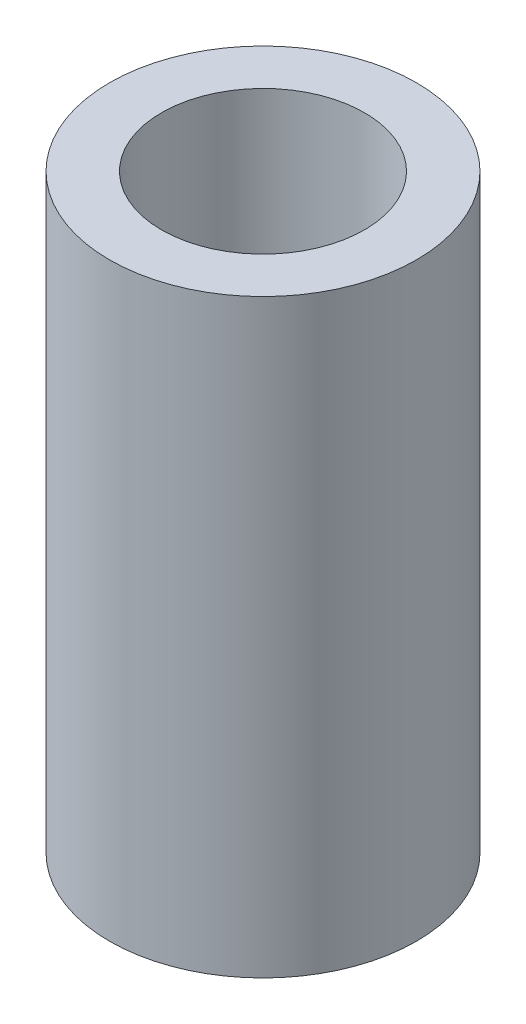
ISO-10303-21;
HEADER;
FILE_DESCRIPTION(('STEP AP214'),'2;1');
FILE_NAME('part.step','',(''),(''),'','','');
FILE_SCHEMA(('AUTOMOTIVE_DESIGN { 1 0 10303 214 1 1 1 1 }'));
ENDSEC;
DATA;
#1=APPLICATION_CONTEXT('core data for automotive mechanical design processes');
#2=APPLICATION_PROTOCOL_DEFINITION('international standard','automotive_design',2000,#1);
#3=PRODUCT_CONTEXT('',#1,'mechanical');
#4=PRODUCT('Part','Part','',(#3));
#5=PRODUCT_RELATED_PRODUCT_CATEGORY('part','',(#4));
#6=PRODUCT_DEFINITION_FORMATION('','',#4);
#7=PRODUCT_DEFINITION_CONTEXT('part definition',#1,'design');
#8=PRODUCT_DEFINITION('design','',#6,#7);
#9=PRODUCT_DEFINITION_SHAPE('','',#8);
#10=(LENGTH_UNIT() NAMED_UNIT(*) SI_UNIT(.MILLI.,.METRE.));
#11=(NAMED_UNIT(*) PLANE_ANGLE_UNIT() SI_UNIT($,.RADIAN.));
#12=(NAMED_UNIT(*) SI_UNIT($,.STERADIAN.) SOLID_ANGLE_UNIT());
#13=UNCERTAINTY_MEASURE_WITH_UNIT(LENGTH_MEASURE(1.E-05),#10,'distance_accuracy_value','');
#14=(GEOMETRIC_REPRESENTATION_CONTEXT(3) GLOBAL_UNCERTAINTY_ASSIGNED_CONTEXT((#13)) GLOBAL_UNIT_ASSIGNED_CONTEXT((#10,
#11,#12)) REPRESENTATION_CONTEXT('',''));
#15=CARTESIAN_POINT('',(0.,0.,0.));
#16=DIRECTION('',(0.,0.,1.));
#17=DIRECTION('',(1.,0.,0.));
#18=AXIS2_PLACEMENT_3D('',#15,#16,#17);
#19=CARTESIAN_POINT('',(0.,-35.,13.55));
#20=DIRECTION('',(0.,1.,0.));
#21=DIRECTION('',(0.,0.,1.));
#22=AXIS2_PLACEMENT_3D('',#19,#20,#21);
#23=CYLINDRICAL_SURFACE('',#22,2.15);
#24=DIRECTION('',(0.,1.,0.));
#25=VECTOR('',#24,1.);
#26=CARTESIAN_POINT('',(0.,-35.,15.7));
#27=LINE('',#26,#25);
#28=CARTESIAN_POINT('',(0.,-35.,15.7));
#29=VERTEX_POINT('',#28);
#30=CARTESIAN_POINT('',(0.,-22.5,15.7));
#31=VERTEX_POINT('',#30);
#32=EDGE_CURVE('E10',#29,#31,#27,.T.);
#33=ORIENTED_EDGE('',*,*,#32,.F.);
#34=CARTESIAN_POINT('',(0.,-35.,13.55));
#35=DIRECTION('',(0.,1.,0.));
#36=DIRECTION('',(0.,0.,1.));
#37=AXIS2_PLACEMENT_3D('',#34,#35,#36);
#38=CIRCLE('',#37,2.15);
#39=EDGE_CURVE('E27',#29,#29,#38,.T.);
#40=ORIENTED_EDGE('',*,*,#39,.F.);
#41=ORIENTED_EDGE('',*,*,#32,.T.);
#42=CARTESIAN_POINT('',(0.,-22.5,13.55));
#43=DIRECTION('',(0.,1.,0.));
#44=DIRECTION('',(0.,0.,1.));
#45=AXIS2_PLACEMENT_3D('',#42,#43,#44);
#46=CIRCLE('',#45,2.15);
#47=EDGE_CURVE('E58',#31,#31,#46,.T.);
#48=ORIENTED_EDGE('',*,*,#47,.T.);
#49=EDGE_LOOP('',(#33,#40,#41,#48));
#50=FACE_BOUND('',#49,.T.);
#51=ADVANCED_FACE('F16',(#50),#23,.F.);
#52=CARTESIAN_POINT('',(0.,-35.,13.55));
#53=DIRECTION('',(0.,1.,0.));
#54=DIRECTION('',(0.,0.,-1.));
#55=AXIS2_PLACEMENT_3D('',#52,#53,#54);
#56=PLANE('',#55);
#57=ORIENTED_EDGE('',*,*,#39,.T.);
#58=EDGE_LOOP('',(#57));
#59=FACE_BOUND('',#58,.T.);
#60=CARTESIAN_POINT('',(0.,-35.,13.55));
#61=DIRECTION('',(0.,1.,0.));
#62=DIRECTION('',(0.,0.,1.));
#63=AXIS2_PLACEMENT_3D('',#60,#61,#62);
#64=CIRCLE('',#63,3.25);
#65=CARTESIAN_POINT('',(0.,-35.,16.8));
#66=VERTEX_POINT('',#65);
#67=EDGE_CURVE('E54',#66,#66,#64,.T.);
#68=ORIENTED_EDGE('',*,*,#67,.F.);
#69=EDGE_LOOP('',(#68));
#70=FACE_BOUND('',#69,.T.);
#71=ADVANCED_FACE('F69',(#59,#70),#56,.F.);
#72=CARTESIAN_POINT('',(0.,-22.5,13.55));
#73=DIRECTION('',(0.,1.,0.));
#74=DIRECTION('',(0.,0.,-1.));
#75=AXIS2_PLACEMENT_3D('',#72,#73,#74);
#76=PLANE('',#75);
#77=ORIENTED_EDGE('',*,*,#47,.F.);
#78=EDGE_LOOP('',(#77));
#79=FACE_BOUND('',#78,.T.);
#80=CARTESIAN_POINT('',(0.,-22.5,13.55));
#81=DIRECTION('',(0.,1.,0.));
#82=DIRECTION('',(0.,0.,1.));
#83=AXIS2_PLACEMENT_3D('',#80,#81,#82);
#84=CIRCLE('',#83,3.25);
#85=CARTESIAN_POINT('',(0.,-22.5,16.8));
#86=VERTEX_POINT('',#85);
#87=EDGE_CURVE('E20',#86,#86,#84,.T.);
#88=ORIENTED_EDGE('',*,*,#87,.T.);
#89=EDGE_LOOP('',(#88));
#90=FACE_BOUND('',#89,.T.);
#91=ADVANCED_FACE('F18',(#79,#90),#76,.T.);
#92=CARTESIAN_POINT('',(0.,-35.,13.55));
#93=DIRECTION('',(0.,1.,0.));
#94=DIRECTION('',(0.,0.,1.));
#95=AXIS2_PLACEMENT_3D('',#92,#93,#94);
#96=CYLINDRICAL_SURFACE('',#95,3.25);
#97=ORIENTED_EDGE('',*,*,#87,.F.);
#98=DIRECTION('',(0.,1.,0.));
#99=VECTOR('',#98,1.);
#100=CARTESIAN_POINT('',(0.,-35.,16.8));
#101=LINE('',#100,#99);
#102=EDGE_CURVE('E49',#66,#86,#101,.T.);
#103=ORIENTED_EDGE('',*,*,#102,.F.);
#104=ORIENTED_EDGE('',*,*,#67,.T.);
#105=ORIENTED_EDGE('',*,*,#102,.T.);
#106=EDGE_LOOP('',(#97,#103,#104,#105));
#107=FACE_BOUND('',#106,.T.);
#108=ADVANCED_FACE('F55',(#107),#96,.T.);
#109=CLOSED_SHELL('',(#51,#71,#91,#108));
#110=MANIFOLD_SOLID_BREP('B1',#109);
#111=ADVANCED_BREP_SHAPE_REPRESENTATION('',(#18,#110),#14);
#112=SHAPE_DEFINITION_REPRESENTATION(#9,#111);
ENDSEC;
END-ISO-10303-21;
